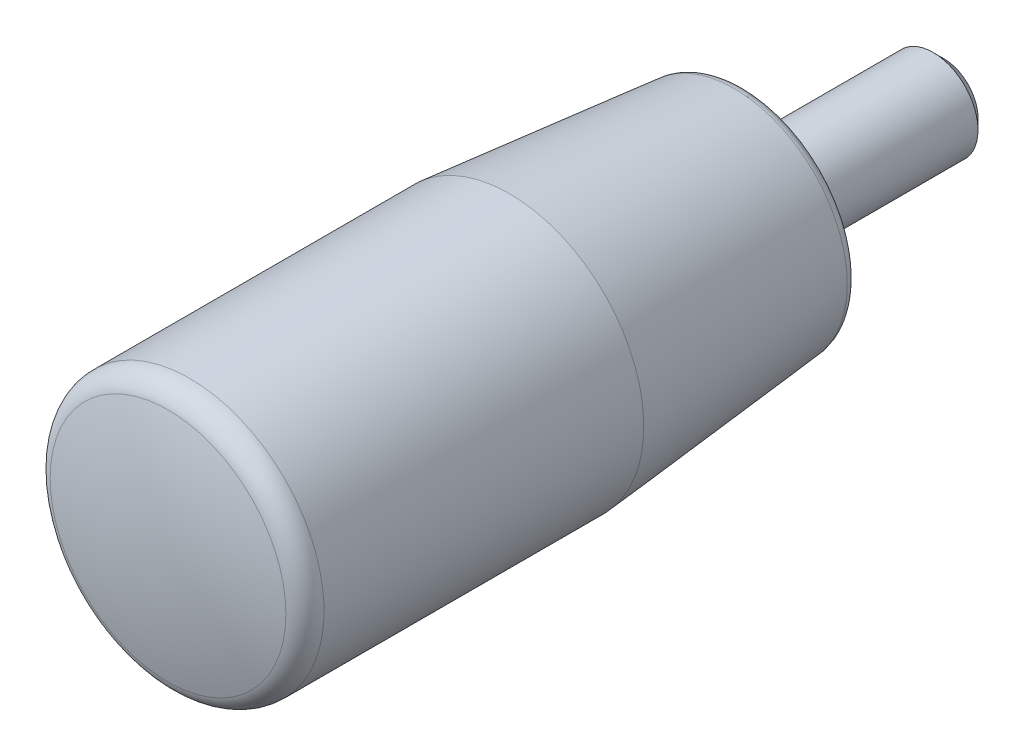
ISO-10303-21;
HEADER;
FILE_DESCRIPTION(('STEP AP214'),'2;1');
FILE_NAME('part.step','',(''),(''),'','','');
FILE_SCHEMA(('AUTOMOTIVE_DESIGN { 1 0 10303 214 1 1 1 1 }'));
ENDSEC;
DATA;
#1=APPLICATION_CONTEXT('core data for automotive mechanical design processes');
#2=APPLICATION_PROTOCOL_DEFINITION('international standard','automotive_design',2000,#1);
#3=PRODUCT_CONTEXT('',#1,'mechanical');
#4=PRODUCT('Part','Part','',(#3));
#5=PRODUCT_RELATED_PRODUCT_CATEGORY('part','',(#4));
#6=PRODUCT_DEFINITION_FORMATION('','',#4);
#7=PRODUCT_DEFINITION_CONTEXT('part definition',#1,'design');
#8=PRODUCT_DEFINITION('design','',#6,#7);
#9=PRODUCT_DEFINITION_SHAPE('','',#8);
#10=(LENGTH_UNIT() NAMED_UNIT(*) SI_UNIT(.MILLI.,.METRE.));
#11=(NAMED_UNIT(*) PLANE_ANGLE_UNIT() SI_UNIT($,.RADIAN.));
#12=(NAMED_UNIT(*) SI_UNIT($,.STERADIAN.) SOLID_ANGLE_UNIT());
#13=UNCERTAINTY_MEASURE_WITH_UNIT(LENGTH_MEASURE(1.E-05),#10,'distance_accuracy_value','');
#14=(GEOMETRIC_REPRESENTATION_CONTEXT(3) GLOBAL_UNCERTAINTY_ASSIGNED_CONTEXT((#13)) GLOBAL_UNIT_ASSIGNED_CONTEXT((#10,
#11,#12)) REPRESENTATION_CONTEXT('',''));
#15=CARTESIAN_POINT('',(0.,0.,0.));
#16=DIRECTION('',(0.,0.,1.));
#17=DIRECTION('',(1.,0.,0.));
#18=AXIS2_PLACEMENT_3D('',#15,#16,#17);
#19=CARTESIAN_POINT('',(0.,0.,37.495454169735));
#20=DIRECTION('',(0.,0.,-1.));
#21=DIRECTION('',(-1.,0.,0.));
#22=AXIS2_PLACEMENT_3D('',#19,#20,#21);
#23=TOROIDAL_SURFACE('',#22,7.5,1.50000000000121);
#24=CARTESIAN_POINT('',(0.,0.,37.4954568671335));
#25=DIRECTION('',(0.,0.,-1.));
#26=DIRECTION('',(-1.,0.,0.));
#27=AXIS2_PLACEMENT_3D('',#24,#25,#26);
#28=CIRCLE('',#27,9.);
#29=CARTESIAN_POINT('',(-9.,0.,37.4954568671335));
#30=VERTEX_POINT('',#29);
#31=EDGE_CURVE('E142',#30,#30,#28,.T.);
#32=ORIENTED_EDGE('',*,*,#31,.F.);
#33=EDGE_LOOP('',(#32));
#34=FACE_BOUND('',#33,.T.);
#35=CARTESIAN_POINT('',(0.,0.,38.9425833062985));
#36=DIRECTION('',(0.,0.,-1.));
#37=DIRECTION('',(-1.,0.,0.));
#38=AXIS2_PLACEMENT_3D('',#35,#36,#37);
#39=CIRCLE('',#38,7.89473695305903);
#40=CARTESIAN_POINT('',(-7.89473695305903,0.,38.9425833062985));
#41=VERTEX_POINT('',#40);
#42=EDGE_CURVE('E116',#41,#41,#39,.T.);
#43=ORIENTED_EDGE('',*,*,#42,.T.);
#44=EDGE_LOOP('',(#43));
#45=FACE_BOUND('',#44,.T.);
#46=ADVANCED_FACE('F14',(#34,#45),#23,.T.);
#47=CARTESIAN_POINT('',(0.,0.,-18.));
#48=DIRECTION('',(0.,0.,-1.));
#49=DIRECTION('',(-1.,0.,0.));
#50=AXIS2_PLACEMENT_3D('',#47,#48,#49);
#51=CYLINDRICAL_SURFACE('',#50,9.);
#52=CARTESIAN_POINT('',(0.,0.,16.0801493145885));
#53=DIRECTION('',(0.,0.,-1.));
#54=DIRECTION('',(-1.,0.,0.));
#55=AXIS2_PLACEMENT_3D('',#52,#53,#54);
#56=CIRCLE('',#55,9.);
#57=CARTESIAN_POINT('',(-9.,0.,16.0801493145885));
#58=VERTEX_POINT('',#57);
#59=EDGE_CURVE('E139',#58,#58,#56,.T.);
#60=ORIENTED_EDGE('',*,*,#59,.F.);
#61=EDGE_LOOP('',(#60));
#62=FACE_BOUND('',#61,.T.);
#63=ORIENTED_EDGE('',*,*,#31,.T.);
#64=EDGE_LOOP('',(#63));
#65=FACE_BOUND('',#64,.T.);
#66=ADVANCED_FACE('F165',(#62,#65),#51,.T.);
#67=CARTESIAN_POINT('',(0.,0.,1.024294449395));
#68=DIRECTION('',(0.,0.,1.));
#69=DIRECTION('',(1.,0.,0.));
#70=AXIS2_PLACEMENT_3D('',#67,#68,#69);
#71=CONICAL_SURFACE('',#70,7.56884863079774,0.09477137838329);
#72=ORIENTED_EDGE('',*,*,#59,.T.);
#73=EDGE_LOOP('',(#72));
#74=FACE_BOUND('',#73,.T.);
#75=CARTESIAN_POINT('',(0.,0.,1.024294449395));
#76=DIRECTION('',(0.,0.,-1.));
#77=DIRECTION('',(-1.,0.,0.));
#78=AXIS2_PLACEMENT_3D('',#75,#76,#77);
#79=CIRCLE('',#78,7.56884863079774);
#80=CARTESIAN_POINT('',(-7.56884863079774,0.,1.024294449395));
#81=VERTEX_POINT('',#80);
#82=EDGE_CURVE('E136',#81,#81,#79,.T.);
#83=ORIENTED_EDGE('',*,*,#82,.F.);
#84=EDGE_LOOP('',(#83));
#85=FACE_BOUND('',#84,.T.);
#86=ADVANCED_FACE('F171',(#74,#85),#71,.T.);
#87=CARTESIAN_POINT('',(0.,0.,1.1));
#88=DIRECTION('',(0.,0.,-1.));
#89=DIRECTION('',(-1.,0.,0.));
#90=AXIS2_PLACEMENT_3D('',#87,#88,#89);
#91=TOROIDAL_SURFACE('',#90,6.77243876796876,0.800000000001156);
#92=CARTESIAN_POINT('',(0.,0.,0.299999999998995));
#93=DIRECTION('',(0.,0.,-1.));
#94=DIRECTION('',(-1.,0.,0.));
#95=AXIS2_PLACEMENT_3D('',#92,#93,#94);
#96=CIRCLE('',#95,6.77243876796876);
#97=CARTESIAN_POINT('',(-6.77243876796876,0.,0.299999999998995));
#98=VERTEX_POINT('',#97);
#99=EDGE_CURVE('E133',#98,#98,#96,.T.);
#100=ORIENTED_EDGE('',*,*,#99,.F.);
#101=EDGE_LOOP('',(#100));
#102=FACE_BOUND('',#101,.T.);
#103=ORIENTED_EDGE('',*,*,#82,.T.);
#104=EDGE_LOOP('',(#103));
#105=FACE_BOUND('',#104,.T.);
#106=ADVANCED_FACE('F179',(#102,#105),#91,.T.);
#107=CARTESIAN_POINT('',(0.,6.77243876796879,0.299999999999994));
#108=DIRECTION('',(0.,0.,1.));
#109=DIRECTION('',(1.,0.,0.));
#110=AXIS2_PLACEMENT_3D('',#107,#108,#109);
#111=PLANE('',#110);
#112=CARTESIAN_POINT('',(0.,0.,0.299999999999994));
#113=DIRECTION('',(0.,0.,-1.));
#114=DIRECTION('',(-1.,0.,0.));
#115=AXIS2_PLACEMENT_3D('',#112,#113,#114);
#116=CIRCLE('',#115,5.);
#117=CARTESIAN_POINT('',(-5.,0.,0.299999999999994));
#118=VERTEX_POINT('',#117);
#119=EDGE_CURVE('E130',#118,#118,#116,.T.);
#120=ORIENTED_EDGE('',*,*,#119,.F.);
#121=EDGE_LOOP('',(#120));
#122=FACE_BOUND('',#121,.T.);
#123=ORIENTED_EDGE('',*,*,#99,.T.);
#124=EDGE_LOOP('',(#123));
#125=FACE_BOUND('',#124,.T.);
#126=ADVANCED_FACE('F183',(#122,#125),#111,.F.);
#127=CARTESIAN_POINT('',(0.,0.,-18.));
#128=DIRECTION('',(0.,0.,-1.));
#129=DIRECTION('',(-1.,0.,0.));
#130=AXIS2_PLACEMENT_3D('',#127,#128,#129);
#131=CYLINDRICAL_SURFACE('',#130,5.);
#132=ORIENTED_EDGE('',*,*,#119,.T.);
#133=EDGE_LOOP('',(#132));
#134=FACE_BOUND('',#133,.T.);
#135=CARTESIAN_POINT('',(0.,0.,0.));
#136=DIRECTION('',(0.,0.,-1.));
#137=DIRECTION('',(-1.,0.,0.));
#138=AXIS2_PLACEMENT_3D('',#135,#136,#137);
#139=CIRCLE('',#138,5.);
#140=CARTESIAN_POINT('',(-5.,0.,0.));
#141=VERTEX_POINT('',#140);
#142=EDGE_CURVE('E127',#141,#141,#139,.T.);
#143=ORIENTED_EDGE('',*,*,#142,.F.);
#144=EDGE_LOOP('',(#143));
#145=FACE_BOUND('',#144,.T.);
#146=ADVANCED_FACE('F187',(#134,#145),#131,.T.);
#147=CARTESIAN_POINT('',(0.,5.,0.));
#148=DIRECTION('',(0.,0.,1.));
#149=DIRECTION('',(1.,0.,0.));
#150=AXIS2_PLACEMENT_3D('',#147,#148,#149);
#151=PLANE('',#150);
#152=CARTESIAN_POINT('',(0.,0.,0.));
#153=DIRECTION('',(0.,0.,-1.));
#154=DIRECTION('',(-1.,0.,0.));
#155=AXIS2_PLACEMENT_3D('',#152,#153,#154);
#156=CIRCLE('',#155,3.);
#157=CARTESIAN_POINT('',(-3.,0.,0.));
#158=VERTEX_POINT('',#157);
#159=EDGE_CURVE('E124',#158,#158,#156,.T.);
#160=ORIENTED_EDGE('',*,*,#159,.F.);
#161=EDGE_LOOP('',(#160));
#162=FACE_BOUND('',#161,.T.);
#163=ORIENTED_EDGE('',*,*,#142,.T.);
#164=EDGE_LOOP('',(#163));
#165=FACE_BOUND('',#164,.T.);
#166=ADVANCED_FACE('F191',(#162,#165),#151,.F.);
#167=CARTESIAN_POINT('',(0.,0.,-18.));
#168=DIRECTION('',(0.,0.,-1.));
#169=DIRECTION('',(-1.,0.,0.));
#170=AXIS2_PLACEMENT_3D('',#167,#168,#169);
#171=CYLINDRICAL_SURFACE('',#170,3.);
#172=CARTESIAN_POINT('',(0.,0.,-12.3));
#173=DIRECTION('',(0.,0.,1.));
#174=DIRECTION('',(1.,0.,0.));
#175=AXIS2_PLACEMENT_3D('',#172,#173,#174);
#176=CIRCLE('',#175,3.);
#177=CARTESIAN_POINT('',(3.,0.,-12.3));
#178=VERTEX_POINT('',#177);
#179=EDGE_CURVE('E9',#178,#178,#176,.T.);
#180=ORIENTED_EDGE('',*,*,#179,.T.);
#181=EDGE_LOOP('',(#180));
#182=FACE_BOUND('',#181,.T.);
#183=ORIENTED_EDGE('',*,*,#159,.T.);
#184=EDGE_LOOP('',(#183));
#185=FACE_BOUND('',#184,.T.);
#186=ADVANCED_FACE('F195',(#182,#185),#171,.T.);
#187=CARTESIAN_POINT('',(0.,0.,10.));
#188=DIRECTION('',(-1.,0.,0.));
#189=DIRECTION('',(0.,0.,1.));
#190=AXIS2_PLACEMENT_3D('',#187,#188,#189);
#191=SPHERICAL_SURFACE('',#190,30.);
#192=CARTESIAN_POINT('',(0.,0.,10.));
#193=DIRECTION('',(0.,0.,-1.));
#194=DIRECTION('',(-1.,0.,0.));
#195=AXIS2_PLACEMENT_3D('',#192,#193,#194);
#196=SPHERICAL_SURFACE('',#195,30.);
#197=ORIENTED_EDGE('',*,*,#42,.F.);
#198=EDGE_LOOP('',(#197));
#199=FACE_BOUND('',#198,.T.);
#200=ADVANCED_FACE('F160',(#199),#196,.T.);
#201=CARTESIAN_POINT('',(0.,3.,-13.));
#202=DIRECTION('',(0.,0.,1.));
#203=DIRECTION('',(1.,0.,0.));
#204=AXIS2_PLACEMENT_3D('',#201,#202,#203);
#205=PLANE('',#204);
#206=DIRECTION('',(-0.866025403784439,0.5,0.));
#207=VECTOR('',#206,1.);
#208=CARTESIAN_POINT('',(0.,-1.73205080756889,-13.));
#209=LINE('',#208,#207);
#210=CARTESIAN_POINT('',(0.,-1.73205080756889,-13.));
#211=VERTEX_POINT('',#210);
#212=CARTESIAN_POINT('',(-1.5,-0.866025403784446,-13.));
#213=VERTEX_POINT('',#212);
#214=EDGE_CURVE('E103',#211,#213,#209,.T.);
#215=ORIENTED_EDGE('',*,*,#214,.F.);
#216=DIRECTION('',(-0.866025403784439,-0.5,0.));
#217=VECTOR('',#216,1.);
#218=CARTESIAN_POINT('',(1.5,-0.866025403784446,-13.));
#219=LINE('',#218,#217);
#220=CARTESIAN_POINT('',(1.5,-0.866025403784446,-13.));
#221=VERTEX_POINT('',#220);
#222=EDGE_CURVE('E29',#221,#211,#219,.T.);
#223=ORIENTED_EDGE('',*,*,#222,.F.);
#224=DIRECTION('',(0.,-1.,0.));
#225=VECTOR('',#224,1.);
#226=CARTESIAN_POINT('',(1.5,0.866025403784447,-13.));
#227=LINE('',#226,#225);
#228=CARTESIAN_POINT('',(1.5,0.866025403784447,-13.));
#229=VERTEX_POINT('',#228);
#230=EDGE_CURVE('E112',#229,#221,#227,.T.);
#231=ORIENTED_EDGE('',*,*,#230,.F.);
#232=DIRECTION('',(0.866025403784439,-0.5,0.));
#233=VECTOR('',#232,1.);
#234=CARTESIAN_POINT('',(0.,1.73205080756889,-13.));
#235=LINE('',#234,#233);
#236=CARTESIAN_POINT('',(0.,1.73205080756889,-13.));
#237=VERTEX_POINT('',#236);
#238=EDGE_CURVE('E110',#237,#229,#235,.T.);
#239=ORIENTED_EDGE('',*,*,#238,.F.);
#240=DIRECTION('',(0.866025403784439,0.5,0.));
#241=VECTOR('',#240,1.);
#242=CARTESIAN_POINT('',(-1.5,0.866025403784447,-13.));
#243=LINE('',#242,#241);
#244=CARTESIAN_POINT('',(-1.5,0.866025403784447,-13.));
#245=VERTEX_POINT('',#244);
#246=EDGE_CURVE('E77',#245,#237,#243,.T.);
#247=ORIENTED_EDGE('',*,*,#246,.F.);
#248=DIRECTION('',(0.,1.,0.));
#249=VECTOR('',#248,1.);
#250=CARTESIAN_POINT('',(-1.5,-0.866025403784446,-13.));
#251=LINE('',#250,#249);
#252=EDGE_CURVE('E106',#213,#245,#251,.T.);
#253=ORIENTED_EDGE('',*,*,#252,.F.);
#254=EDGE_LOOP('',(#215,#223,#231,#239,#247,#253));
#255=FACE_BOUND('',#254,.T.);
#256=CARTESIAN_POINT('',(0.,0.,-13.));
#257=DIRECTION('',(0.,0.,1.));
#258=DIRECTION('',(1.,0.,0.));
#259=AXIS2_PLACEMENT_3D('',#256,#257,#258);
#260=CIRCLE('',#259,2.3);
#261=CARTESIAN_POINT('',(2.3,0.,-13.));
#262=VERTEX_POINT('',#261);
#263=EDGE_CURVE('E22',#262,#262,#260,.F.);
#264=ORIENTED_EDGE('',*,*,#263,.T.);
#265=EDGE_LOOP('',(#264));
#266=FACE_BOUND('',#265,.T.);
#267=ADVANCED_FACE('F147',(#255,#266),#205,.F.);
#268=CARTESIAN_POINT('',(0.,0.,-13.));
#269=DIRECTION('',(0.,0.,1.));
#270=DIRECTION('',(1.,0.,0.));
#271=AXIS2_PLACEMENT_3D('',#268,#269,#270);
#272=CONICAL_SURFACE('',#271,2.3,0.785398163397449);
#273=ORIENTED_EDGE('',*,*,#179,.F.);
#274=EDGE_LOOP('',(#273));
#275=FACE_BOUND('',#274,.T.);
#276=ORIENTED_EDGE('',*,*,#263,.F.);
#277=EDGE_LOOP('',(#276));
#278=FACE_BOUND('',#277,.T.);
#279=ADVANCED_FACE('F16',(#275,#278),#272,.T.);
#280=CARTESIAN_POINT('',(1.5,-0.866025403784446,-9.));
#281=DIRECTION('',(0.5,-0.866025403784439,0.));
#282=DIRECTION('',(0.866025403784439,0.5,0.));
#283=AXIS2_PLACEMENT_3D('',#280,#281,#282);
#284=PLANE('',#283);
#285=ORIENTED_EDGE('',*,*,#222,.T.);
#286=DIRECTION('',(0.,0.,-1.));
#287=VECTOR('',#286,1.);
#288=CARTESIAN_POINT('',(0.,-1.73205080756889,-9.));
#289=LINE('',#288,#287);
#290=CARTESIAN_POINT('',(0.,-1.73205080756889,-9.));
#291=VERTEX_POINT('',#290);
#292=EDGE_CURVE('E59',#291,#211,#289,.T.);
#293=ORIENTED_EDGE('',*,*,#292,.F.);
#294=DIRECTION('',(-0.866025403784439,-0.5,0.));
#295=VECTOR('',#294,1.);
#296=CARTESIAN_POINT('',(1.5,-0.866025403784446,-9.));
#297=LINE('',#296,#295);
#298=CARTESIAN_POINT('',(1.5,-0.866025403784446,-9.));
#299=VERTEX_POINT('',#298);
#300=EDGE_CURVE('E114',#299,#291,#297,.T.);
#301=ORIENTED_EDGE('',*,*,#300,.F.);
#302=DIRECTION('',(0.,0.,-1.));
#303=VECTOR('',#302,1.);
#304=CARTESIAN_POINT('',(1.5,-0.866025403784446,-9.));
#305=LINE('',#304,#303);
#306=EDGE_CURVE('E37',#299,#221,#305,.T.);
#307=ORIENTED_EDGE('',*,*,#306,.T.);
#308=EDGE_LOOP('',(#285,#293,#301,#307));
#309=FACE_BOUND('',#308,.T.);
#310=ADVANCED_FACE('F150',(#309),#284,.F.);
#311=CARTESIAN_POINT('',(1.5,0.866025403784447,-9.));
#312=DIRECTION('',(1.,0.,0.));
#313=DIRECTION('',(0.,0.,-1.));
#314=AXIS2_PLACEMENT_3D('',#311,#312,#313);
#315=PLANE('',#314);
#316=ORIENTED_EDGE('',*,*,#230,.T.);
#317=ORIENTED_EDGE('',*,*,#306,.F.);
#318=DIRECTION('',(0.,-1.,0.));
#319=VECTOR('',#318,1.);
#320=CARTESIAN_POINT('',(1.5,0.866025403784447,-9.));
#321=LINE('',#320,#319);
#322=CARTESIAN_POINT('',(1.5,0.866025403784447,-9.));
#323=VERTEX_POINT('',#322);
#324=EDGE_CURVE('E89',#323,#299,#321,.T.);
#325=ORIENTED_EDGE('',*,*,#324,.F.);
#326=DIRECTION('',(0.,0.,-1.));
#327=VECTOR('',#326,1.);
#328=CARTESIAN_POINT('',(1.5,0.866025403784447,-9.));
#329=LINE('',#328,#327);
#330=EDGE_CURVE('E81',#323,#229,#329,.T.);
#331=ORIENTED_EDGE('',*,*,#330,.T.);
#332=EDGE_LOOP('',(#316,#317,#325,#331));
#333=FACE_BOUND('',#332,.T.);
#334=ADVANCED_FACE('F158',(#333),#315,.F.);
#335=CARTESIAN_POINT('',(0.,1.73205080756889,-9.));
#336=DIRECTION('',(0.5,0.866025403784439,0.));
#337=DIRECTION('',(-0.866025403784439,0.5,0.));
#338=AXIS2_PLACEMENT_3D('',#335,#336,#337);
#339=PLANE('',#338);
#340=ORIENTED_EDGE('',*,*,#238,.T.);
#341=ORIENTED_EDGE('',*,*,#330,.F.);
#342=DIRECTION('',(0.866025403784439,-0.5,0.));
#343=VECTOR('',#342,1.);
#344=CARTESIAN_POINT('',(0.,1.73205080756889,-9.));
#345=LINE('',#344,#343);
#346=CARTESIAN_POINT('',(0.,1.73205080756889,-9.));
#347=VERTEX_POINT('',#346);
#348=EDGE_CURVE('E85',#347,#323,#345,.T.);
#349=ORIENTED_EDGE('',*,*,#348,.F.);
#350=DIRECTION('',(0.,0.,-1.));
#351=VECTOR('',#350,1.);
#352=CARTESIAN_POINT('',(0.,1.73205080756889,-9.));
#353=LINE('',#352,#351);
#354=EDGE_CURVE('E70',#347,#237,#353,.T.);
#355=ORIENTED_EDGE('',*,*,#354,.T.);
#356=EDGE_LOOP('',(#340,#341,#349,#355));
#357=FACE_BOUND('',#356,.T.);
#358=ADVANCED_FACE('F86',(#357),#339,.F.);
#359=CARTESIAN_POINT('',(-1.5,0.866025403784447,-9.));
#360=DIRECTION('',(-0.5,0.866025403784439,0.));
#361=DIRECTION('',(-0.866025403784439,-0.5,0.));
#362=AXIS2_PLACEMENT_3D('',#359,#360,#361);
#363=PLANE('',#362);
#364=ORIENTED_EDGE('',*,*,#246,.T.);
#365=ORIENTED_EDGE('',*,*,#354,.F.);
#366=DIRECTION('',(0.866025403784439,0.5,0.));
#367=VECTOR('',#366,1.);
#368=CARTESIAN_POINT('',(-1.5,0.866025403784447,-9.));
#369=LINE('',#368,#367);
#370=CARTESIAN_POINT('',(-1.5,0.866025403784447,-9.));
#371=VERTEX_POINT('',#370);
#372=EDGE_CURVE('E74',#371,#347,#369,.T.);
#373=ORIENTED_EDGE('',*,*,#372,.F.);
#374=DIRECTION('',(0.,0.,-1.));
#375=VECTOR('',#374,1.);
#376=CARTESIAN_POINT('',(-1.5,0.866025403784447,-9.));
#377=LINE('',#376,#375);
#378=EDGE_CURVE('E82',#371,#245,#377,.T.);
#379=ORIENTED_EDGE('',*,*,#378,.T.);
#380=EDGE_LOOP('',(#364,#365,#373,#379));
#381=FACE_BOUND('',#380,.T.);
#382=ADVANCED_FACE('F72',(#381),#363,.F.);
#383=CARTESIAN_POINT('',(-1.5,-0.866025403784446,-9.));
#384=DIRECTION('',(-1.,0.,0.));
#385=DIRECTION('',(0.,-1.,0.));
#386=AXIS2_PLACEMENT_3D('',#383,#384,#385);
#387=PLANE('',#386);
#388=ORIENTED_EDGE('',*,*,#252,.T.);
#389=ORIENTED_EDGE('',*,*,#378,.F.);
#390=DIRECTION('',(0.,1.,0.));
#391=VECTOR('',#390,1.);
#392=CARTESIAN_POINT('',(-1.5,-0.866025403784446,-9.));
#393=LINE('',#392,#391);
#394=CARTESIAN_POINT('',(-1.5,-0.866025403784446,-9.));
#395=VERTEX_POINT('',#394);
#396=EDGE_CURVE('E95',#395,#371,#393,.T.);
#397=ORIENTED_EDGE('',*,*,#396,.F.);
#398=DIRECTION('',(0.,0.,-1.));
#399=VECTOR('',#398,1.);
#400=CARTESIAN_POINT('',(-1.5,-0.866025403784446,-9.));
#401=LINE('',#400,#399);
#402=EDGE_CURVE('E119',#395,#213,#401,.T.);
#403=ORIENTED_EDGE('',*,*,#402,.T.);
#404=EDGE_LOOP('',(#388,#389,#397,#403));
#405=FACE_BOUND('',#404,.T.);
#406=ADVANCED_FACE('F206',(#405),#387,.F.);
#407=CARTESIAN_POINT('',(0.,-1.73205080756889,-9.));
#408=DIRECTION('',(-0.5,-0.866025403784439,0.));
#409=DIRECTION('',(0.866025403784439,-0.5,0.));
#410=AXIS2_PLACEMENT_3D('',#407,#408,#409);
#411=PLANE('',#410);
#412=ORIENTED_EDGE('',*,*,#214,.T.);
#413=ORIENTED_EDGE('',*,*,#402,.F.);
#414=DIRECTION('',(-0.866025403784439,0.5,0.));
#415=VECTOR('',#414,1.);
#416=CARTESIAN_POINT('',(0.,-1.73205080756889,-9.));
#417=LINE('',#416,#415);
#418=EDGE_CURVE('E97',#291,#395,#417,.T.);
#419=ORIENTED_EDGE('',*,*,#418,.F.);
#420=ORIENTED_EDGE('',*,*,#292,.T.);
#421=EDGE_LOOP('',(#412,#413,#419,#420));
#422=FACE_BOUND('',#421,.T.);
#423=ADVANCED_FACE('F203',(#422),#411,.F.);
#424=CARTESIAN_POINT('',(0.,-1.73205080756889,-9.));
#425=DIRECTION('',(0.,0.,-1.));
#426=DIRECTION('',(-1.,0.,0.));
#427=AXIS2_PLACEMENT_3D('',#424,#425,#426);
#428=PLANE('',#427);
#429=ORIENTED_EDGE('',*,*,#300,.T.);
#430=ORIENTED_EDGE('',*,*,#418,.T.);
#431=ORIENTED_EDGE('',*,*,#396,.T.);
#432=ORIENTED_EDGE('',*,*,#372,.T.);
#433=ORIENTED_EDGE('',*,*,#348,.T.);
#434=ORIENTED_EDGE('',*,*,#324,.T.);
#435=EDGE_LOOP('',(#429,#430,#431,#432,#433,#434));
#436=FACE_BOUND('',#435,.T.);
#437=ADVANCED_FACE('F92',(#436),#428,.T.);
#438=CLOSED_SHELL('',(#46,#66,#86,#106,#126,#146,#166,#186,#200,#267,#279,#310,#334,#358,#382,
#406,#423,#437));
#439=MANIFOLD_SOLID_BREP('B1',#438);
#440=ADVANCED_BREP_SHAPE_REPRESENTATION('',(#18,#439),#14);
#441=SHAPE_DEFINITION_REPRESENTATION(#9,#440);
ENDSEC;
END-ISO-10303-21;
